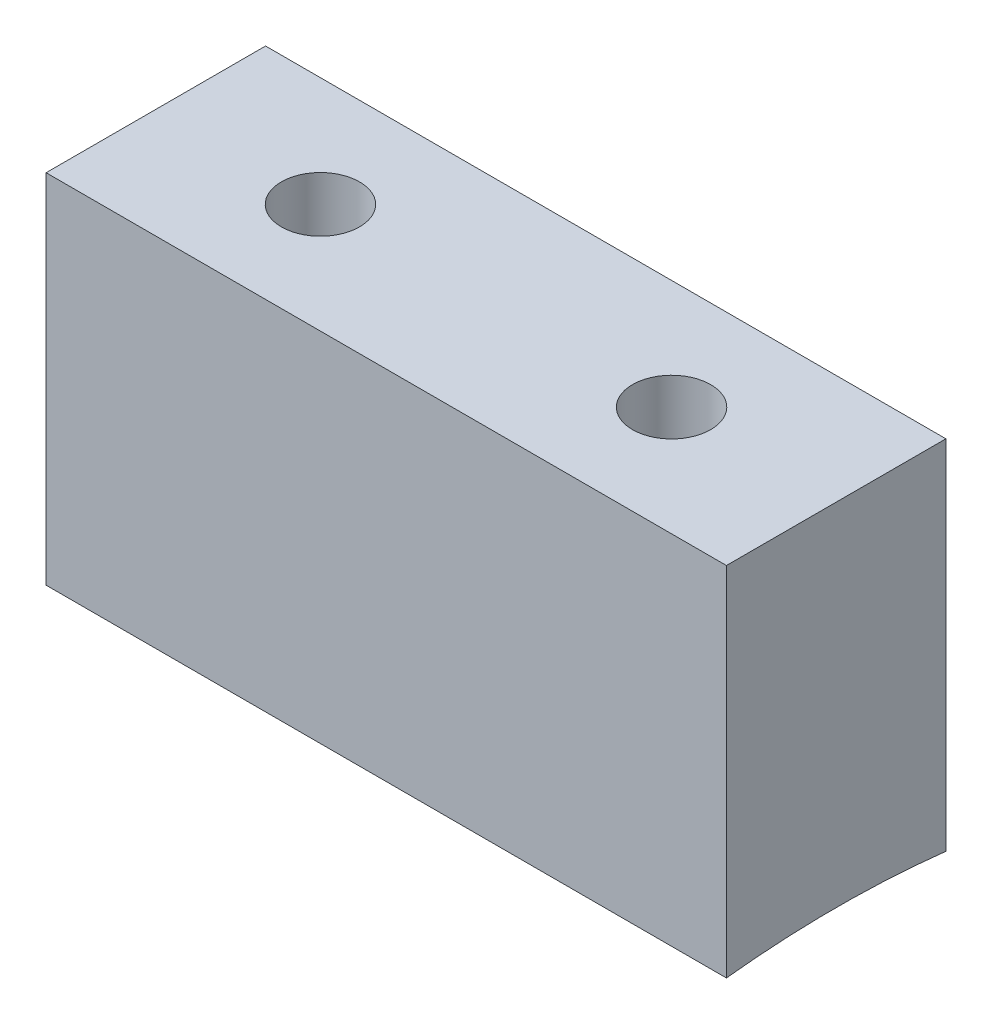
ISO-10303-21;
HEADER;
FILE_DESCRIPTION(('STEP AP214'),'2;1');
FILE_NAME('part.step','',(''),(''),'','','');
FILE_SCHEMA(('AUTOMOTIVE_DESIGN { 1 0 10303 214 1 1 1 1 }'));
ENDSEC;
DATA;
#1=APPLICATION_CONTEXT('core data for automotive mechanical design processes');
#2=APPLICATION_PROTOCOL_DEFINITION('international standard','automotive_design',2000,#1);
#3=PRODUCT_CONTEXT('',#1,'mechanical');
#4=PRODUCT('Part','Part','',(#3));
#5=PRODUCT_RELATED_PRODUCT_CATEGORY('part','',(#4));
#6=PRODUCT_DEFINITION_FORMATION('','',#4);
#7=PRODUCT_DEFINITION_CONTEXT('part definition',#1,'design');
#8=PRODUCT_DEFINITION('design','',#6,#7);
#9=PRODUCT_DEFINITION_SHAPE('','',#8);
#10=(LENGTH_UNIT() NAMED_UNIT(*) SI_UNIT(.MILLI.,.METRE.));
#11=(NAMED_UNIT(*) PLANE_ANGLE_UNIT() SI_UNIT($,.RADIAN.));
#12=(NAMED_UNIT(*) SI_UNIT($,.STERADIAN.) SOLID_ANGLE_UNIT());
#13=UNCERTAINTY_MEASURE_WITH_UNIT(LENGTH_MEASURE(1.E-05),#10,'distance_accuracy_value','');
#14=(GEOMETRIC_REPRESENTATION_CONTEXT(3) GLOBAL_UNCERTAINTY_ASSIGNED_CONTEXT((#13)) GLOBAL_UNIT_ASSIGNED_CONTEXT((#10,
#11,#12)) REPRESENTATION_CONTEXT('',''));
#15=CARTESIAN_POINT('',(0.,0.,0.));
#16=DIRECTION('',(0.,0.,1.));
#17=DIRECTION('',(1.,0.,0.));
#18=AXIS2_PLACEMENT_3D('',#15,#16,#17);
#19=CARTESIAN_POINT('',(0.106166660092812,10.1594452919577,3.175));
#20=DIRECTION('',(1.00000000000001,0.,0.));
#21=DIRECTION('',(0.,1.,0.));
#22=AXIS2_PLACEMENT_3D('',#19,#20,#21);
#23=PLANE('',#22);
#24=DIRECTION('',(0.,-1.,0.));
#25=VECTOR('',#24,1.);
#26=CARTESIAN_POINT('',(0.106166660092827,10.1594452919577,-3.175));
#27=LINE('',#26,#25);
#28=CARTESIAN_POINT('',(0.106166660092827,10.1594452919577,-3.175));
#29=VERTEX_POINT('',#28);
#30=CARTESIAN_POINT('',(0.106166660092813,-0.176936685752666,-3.175));
#31=VERTEX_POINT('',#30);
#32=EDGE_CURVE('E79',#29,#31,#27,.T.);
#33=ORIENTED_EDGE('',*,*,#32,.T.);
#34=CARTESIAN_POINT('',(0.106166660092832,-28.575,0.));
#35=DIRECTION('',(-1.00000000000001,0.,0.));
#36=DIRECTION('',(0.,-1.,0.));
#37=AXIS2_PLACEMENT_3D('',#34,#35,#36);
#38=CIRCLE('',#37,28.575);
#39=CARTESIAN_POINT('',(0.106166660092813,-0.176936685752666,3.175));
#40=VERTEX_POINT('',#39);
#41=EDGE_CURVE('E50',#40,#31,#38,.T.);
#42=ORIENTED_EDGE('',*,*,#41,.F.);
#43=DIRECTION('',(0.,-1.,0.));
#44=VECTOR('',#43,1.);
#45=CARTESIAN_POINT('',(0.106166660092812,10.1594452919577,3.175));
#46=LINE('',#45,#44);
#47=CARTESIAN_POINT('',(0.106166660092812,10.1594452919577,3.175));
#48=VERTEX_POINT('',#47);
#49=EDGE_CURVE('E84',#48,#40,#46,.T.);
#50=ORIENTED_EDGE('',*,*,#49,.F.);
#51=DIRECTION('',(0.,0.,-1.));
#52=VECTOR('',#51,1.);
#53=CARTESIAN_POINT('',(0.106166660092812,10.1594452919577,3.175));
#54=LINE('',#53,#52);
#55=EDGE_CURVE('E99',#48,#29,#54,.T.);
#56=ORIENTED_EDGE('',*,*,#55,.T.);
#57=EDGE_LOOP('',(#33,#42,#50,#56));
#58=FACE_BOUND('',#57,.T.);
#59=ADVANCED_FACE('F31',(#58),#23,.F.);
#60=CARTESIAN_POINT('',(19.791166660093,10.1594452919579,3.175));
#61=DIRECTION('',(-1.00000000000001,0.,0.));
#62=DIRECTION('',(0.,0.,1.));
#63=AXIS2_PLACEMENT_3D('',#60,#61,#62);
#64=PLANE('',#63);
#65=DIRECTION('',(0.,1.,0.));
#66=VECTOR('',#65,1.);
#67=CARTESIAN_POINT('',(19.791166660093,10.1594452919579,3.175));
#68=LINE('',#67,#66);
#69=CARTESIAN_POINT('',(19.791166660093,-0.176936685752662,3.175));
#70=VERTEX_POINT('',#69);
#71=CARTESIAN_POINT('',(19.791166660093,10.1594452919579,3.175));
#72=VERTEX_POINT('',#71);
#73=EDGE_CURVE('E89',#70,#72,#68,.T.);
#74=ORIENTED_EDGE('',*,*,#73,.F.);
#75=CARTESIAN_POINT('',(19.791166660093,-28.575,0.));
#76=DIRECTION('',(-1.00000000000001,0.,0.));
#77=DIRECTION('',(0.,-1.,0.));
#78=AXIS2_PLACEMENT_3D('',#75,#76,#77);
#79=CIRCLE('',#78,28.575);
#80=CARTESIAN_POINT('',(19.791166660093,-0.176936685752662,-3.175));
#81=VERTEX_POINT('',#80);
#82=EDGE_CURVE('E77',#70,#81,#79,.T.);
#83=ORIENTED_EDGE('',*,*,#82,.T.);
#84=DIRECTION('',(0.,1.,0.));
#85=VECTOR('',#84,1.);
#86=CARTESIAN_POINT('',(19.791166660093,10.1594452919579,-3.175));
#87=LINE('',#86,#85);
#88=CARTESIAN_POINT('',(19.791166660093,10.1594452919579,-3.175));
#89=VERTEX_POINT('',#88);
#90=EDGE_CURVE('E94',#81,#89,#87,.T.);
#91=ORIENTED_EDGE('',*,*,#90,.T.);
#92=DIRECTION('',(0.,0.,-1.));
#93=VECTOR('',#92,1.);
#94=CARTESIAN_POINT('',(19.791166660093,10.1594452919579,3.175));
#95=LINE('',#94,#93);
#96=EDGE_CURVE('E43',#72,#89,#95,.T.);
#97=ORIENTED_EDGE('',*,*,#96,.F.);
#98=EDGE_LOOP('',(#74,#83,#91,#97));
#99=FACE_BOUND('',#98,.T.);
#100=ADVANCED_FACE('F135',(#99),#64,.F.);
#101=CARTESIAN_POINT('',(0.106166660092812,10.1594452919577,3.175));
#102=DIRECTION('',(0.,-1.,0.));
#103=DIRECTION('',(1.00000000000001,0.,0.));
#104=AXIS2_PLACEMENT_3D('',#101,#102,#103);
#105=PLANE('',#104);
#106=CARTESIAN_POINT('',(15.0286666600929,10.1594452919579,0.));
#107=DIRECTION('',(0.,1.,0.));
#108=DIRECTION('',(0.,0.,1.));
#109=AXIS2_PLACEMENT_3D('',#106,#107,#108);
#110=CIRCLE('',#109,1.13029999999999);
#111=CARTESIAN_POINT('',(15.0286666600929,10.1594452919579,1.13029999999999));
#112=VERTEX_POINT('',#111);
#113=EDGE_CURVE('E158',#112,#112,#110,.T.);
#114=ORIENTED_EDGE('',*,*,#113,.F.);
#115=EDGE_LOOP('',(#114));
#116=FACE_BOUND('',#115,.T.);
#117=CARTESIAN_POINT('',(4.86866666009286,10.1594452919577,0.));
#118=DIRECTION('',(0.,1.,0.));
#119=DIRECTION('',(0.,0.,1.));
#120=AXIS2_PLACEMENT_3D('',#117,#118,#119);
#121=CIRCLE('',#120,1.13029999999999);
#122=CARTESIAN_POINT('',(4.86866666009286,10.1594452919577,1.13029999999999));
#123=VERTEX_POINT('',#122);
#124=EDGE_CURVE('E118',#123,#123,#121,.T.);
#125=ORIENTED_EDGE('',*,*,#124,.F.);
#126=EDGE_LOOP('',(#125));
#127=FACE_BOUND('',#126,.T.);
#128=ORIENTED_EDGE('',*,*,#96,.T.);
#129=DIRECTION('',(-1.00000000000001,0.,0.));
#130=VECTOR('',#129,1.);
#131=CARTESIAN_POINT('',(0.106166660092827,10.1594452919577,-3.175));
#132=LINE('',#131,#130);
#133=EDGE_CURVE('E90',#89,#29,#132,.T.);
#134=ORIENTED_EDGE('',*,*,#133,.T.);
#135=ORIENTED_EDGE('',*,*,#55,.F.);
#136=DIRECTION('',(-1.00000000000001,0.,0.));
#137=VECTOR('',#136,1.);
#138=CARTESIAN_POINT('',(0.106166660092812,10.1594452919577,3.175));
#139=LINE('',#138,#137);
#140=EDGE_CURVE('E57',#72,#48,#139,.T.);
#141=ORIENTED_EDGE('',*,*,#140,.F.);
#142=EDGE_LOOP('',(#128,#134,#135,#141));
#143=FACE_BOUND('',#142,.T.);
#144=ADVANCED_FACE('F105',(#116,#127,#143),#105,.F.);
#145=CARTESIAN_POINT('',(0.106166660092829,-5.38626770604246,3.175));
#146=DIRECTION('',(0.,0.,1.));
#147=DIRECTION('',(1.00000000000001,0.,0.));
#148=AXIS2_PLACEMENT_3D('',#145,#146,#147);
#149=PLANE('',#148);
#150=DIRECTION('',(-1.00000000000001,0.,0.));
#151=VECTOR('',#150,1.);
#152=CARTESIAN_POINT('',(19.791166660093,-0.176936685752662,3.175));
#153=LINE('',#152,#151);
#154=EDGE_CURVE('E74',#70,#40,#153,.T.);
#155=ORIENTED_EDGE('',*,*,#154,.F.);
#156=ORIENTED_EDGE('',*,*,#73,.T.);
#157=ORIENTED_EDGE('',*,*,#140,.T.);
#158=ORIENTED_EDGE('',*,*,#49,.T.);
#159=EDGE_LOOP('',(#155,#156,#157,#158));
#160=FACE_BOUND('',#159,.T.);
#161=ADVANCED_FACE('F88',(#160),#149,.T.);
#162=CARTESIAN_POINT('',(0.106166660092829,-5.38626770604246,-3.175));
#163=DIRECTION('',(0.,0.,1.));
#164=DIRECTION('',(1.00000000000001,0.,0.));
#165=AXIS2_PLACEMENT_3D('',#162,#163,#164);
#166=PLANE('',#165);
#167=ORIENTED_EDGE('',*,*,#90,.F.);
#168=DIRECTION('',(-1.00000000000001,0.,0.));
#169=VECTOR('',#168,1.);
#170=CARTESIAN_POINT('',(19.791166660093,-0.176936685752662,-3.175));
#171=LINE('',#170,#169);
#172=EDGE_CURVE('E11',#81,#31,#171,.T.);
#173=ORIENTED_EDGE('',*,*,#172,.T.);
#174=ORIENTED_EDGE('',*,*,#32,.F.);
#175=ORIENTED_EDGE('',*,*,#133,.F.);
#176=EDGE_LOOP('',(#167,#173,#174,#175));
#177=FACE_BOUND('',#176,.T.);
#178=ADVANCED_FACE('F109',(#177),#166,.F.);
#179=CARTESIAN_POINT('',(19.791166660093,-28.575,0.));
#180=DIRECTION('',(-1.00000000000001,0.,0.));
#181=DIRECTION('',(0.,-1.,0.));
#182=AXIS2_PLACEMENT_3D('',#179,#180,#181);
#183=CYLINDRICAL_SURFACE('',#182,28.575);
#184=CARTESIAN_POINT('',(15.028666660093,-0.0223635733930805,1.13029999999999));
#185=CARTESIAN_POINT('',(15.0921294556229,-0.0223632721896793,1.13029719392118));
#186=CARTESIAN_POINT('',(15.1556376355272,-0.0221497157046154,1.12493719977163));
#187=CARTESIAN_POINT('',(15.2809031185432,-0.0213183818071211,1.10363052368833));
#188=CARTESIAN_POINT('',(15.3426582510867,-0.0207001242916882,1.08767126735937));
#189=CARTESIAN_POINT('',(15.4625848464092,-0.0191295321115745,1.04562274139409));
#190=CARTESIAN_POINT('',(15.5207580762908,-0.0181773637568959,1.01953851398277));
#191=CARTESIAN_POINT('',(15.6318841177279,-0.0160464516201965,0.957987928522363));
#192=CARTESIAN_POINT('',(15.6848381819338,-0.0148677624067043,0.922523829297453));
#193=CARTESIAN_POINT('',(15.784075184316,-0.0124156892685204,0.843192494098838));
#194=CARTESIAN_POINT('',(15.830354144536,-0.011142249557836,0.799320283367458));
#195=CARTESIAN_POINT('',(15.9148935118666,-0.00864470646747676,0.704427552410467));
#196=CARTESIAN_POINT('',(15.9531535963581,-0.00742060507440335,0.653406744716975));
#197=CARTESIAN_POINT('',(16.0205782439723,-0.00515933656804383,0.545646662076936));
#198=CARTESIAN_POINT('',(16.0497399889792,-0.00412222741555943,0.488905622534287));
#199=CARTESIAN_POINT('',(16.098121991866,-0.00235234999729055,0.371328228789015));
#200=CARTESIAN_POINT('',(16.1173423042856,-0.00161958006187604,0.31049189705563));
#201=CARTESIAN_POINT('',(16.1452861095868,-0.000541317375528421,0.186484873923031));
#202=CARTESIAN_POINT('',(16.1540151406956,-0.000195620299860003,0.123315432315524));
#203=CARTESIAN_POINT('',(16.1607456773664,7.02181342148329E-05,-0.00359303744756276));
#204=CARTESIAN_POINT('',(16.1587472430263,-9.63812332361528E-06,-0.0673320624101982));
#205=CARTESIAN_POINT('',(16.1440842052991,-0.00058573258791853,-0.193532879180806));
#206=CARTESIAN_POINT('',(16.1314255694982,-0.00108173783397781,-0.255995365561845));
#207=CARTESIAN_POINT('',(16.0958107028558,-0.00243397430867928,-0.377908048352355));
#208=CARTESIAN_POINT('',(16.0728544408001,-0.00329020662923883,-0.437358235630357));
#209=CARTESIAN_POINT('',(16.0172891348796,-0.00526681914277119,-0.551577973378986));
#210=CARTESIAN_POINT('',(15.9846773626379,-0.00638727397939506,-0.606346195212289));
#211=CARTESIAN_POINT('',(15.9107287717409,-0.00876609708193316,-0.709632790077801));
#212=CARTESIAN_POINT('',(15.8693919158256,-0.0100244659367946,-0.758151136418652));
#213=CARTESIAN_POINT('',(15.7791327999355,-0.0125383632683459,-0.847595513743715));
#214=CARTESIAN_POINT('',(15.7302053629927,-0.0137938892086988,-0.888516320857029));
#215=CARTESIAN_POINT('',(15.6261721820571,-0.0161596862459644,-0.961563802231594));
#216=CARTESIAN_POINT('',(15.5710664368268,-0.0172699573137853,-0.993690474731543));
#217=CARTESIAN_POINT('',(15.4562378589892,-0.0192199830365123,-1.04823720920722));
#218=CARTESIAN_POINT('',(15.3965149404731,-0.0200597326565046,-1.07065709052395));
#219=CARTESIAN_POINT('',(15.2741486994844,-0.0213738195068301,-1.10515040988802));
#220=CARTESIAN_POINT('',(15.2115053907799,-0.021848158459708,-1.11722389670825));
#221=CARTESIAN_POINT('',(15.0851220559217,-0.0223776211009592,-1.13067527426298));
#222=CARTESIAN_POINT('',(15.0213828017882,-0.0224330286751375,-1.13206040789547));
#223=CARTESIAN_POINT('',(14.8945769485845,-0.0221191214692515,-1.12411464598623));
#224=CARTESIAN_POINT('',(14.8315103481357,-0.0217498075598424,-1.11478377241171));
#225=CARTESIAN_POINT('',(14.7078602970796,-0.020628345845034,-1.08567686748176));
#226=CARTESIAN_POINT('',(14.6472760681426,-0.0198763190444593,-1.06590413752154));
#227=CARTESIAN_POINT('',(14.5302865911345,-0.0180743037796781,-1.01647813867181));
#228=CARTESIAN_POINT('',(14.4738813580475,-0.0170243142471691,-0.986824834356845));
#229=CARTESIAN_POINT('',(14.3668176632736,-0.0147440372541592,-0.918460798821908));
#230=CARTESIAN_POINT('',(14.3161623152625,-0.0135136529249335,-0.879745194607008));
#231=CARTESIAN_POINT('',(14.2220676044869,-0.0110116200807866,-0.7943626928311));
#232=CARTESIAN_POINT('',(14.1786282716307,-0.00973997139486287,-0.747695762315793));
#233=CARTESIAN_POINT('',(14.1001744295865,-0.0072979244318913,-0.647704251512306));
#234=CARTESIAN_POINT('',(14.0651645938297,-0.00612758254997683,-0.594376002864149));
#235=CARTESIAN_POINT('',(14.0045954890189,-0.00402086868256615,-0.482594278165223));
#236=CARTESIAN_POINT('',(13.9790361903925,-0.00308449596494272,-0.42414081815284));
#237=CARTESIAN_POINT('',(13.9381018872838,-0.00155153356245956,-0.303785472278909));
#238=CARTESIAN_POINT('',(13.9227238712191,-0.000954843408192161,-0.241884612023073));
#239=CARTESIAN_POINT('',(13.9025787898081,-0.000168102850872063,-0.116377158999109));
#240=CARTESIAN_POINT('',(13.8978116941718,2.19487129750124E-05,-0.0527705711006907));
#241=CARTESIAN_POINT('',(13.8990241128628,-2.60025469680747E-05,0.0742962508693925));
#242=CARTESIAN_POINT('',(13.9049962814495,-0.000263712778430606,0.137756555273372));
#243=CARTESIAN_POINT('',(13.9275025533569,-0.00113983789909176,0.262772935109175));
#244=CARTESIAN_POINT('',(13.9440366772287,-0.00177825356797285,0.324329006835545));
#245=CARTESIAN_POINT('',(13.9871962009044,-0.00338391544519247,0.44379160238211));
#246=CARTESIAN_POINT('',(14.0138217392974,-0.00435116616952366,0.501698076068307));
#247=CARTESIAN_POINT('',(14.0764065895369,-0.00650559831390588,0.612218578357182));
#248=CARTESIAN_POINT('',(14.1123655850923,-0.00769277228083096,0.664832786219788));
#249=CARTESIAN_POINT('',(14.1926213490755,-0.0101542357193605,0.763310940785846));
#250=CARTESIAN_POINT('',(14.2369229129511,-0.0114285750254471,0.809170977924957));
#251=CARTESIAN_POINT('',(14.3326091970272,-0.0139205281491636,0.892816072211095));
#252=CARTESIAN_POINT('',(14.3839956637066,-0.0151381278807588,0.930599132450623));
#253=CARTESIAN_POINT('',(14.4924215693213,-0.0173798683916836,0.997028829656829));
#254=CARTESIAN_POINT('',(14.549465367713,-0.018403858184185,1.02566834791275));
#255=CARTESIAN_POINT('',(14.6675122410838,-0.0201403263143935,1.07292991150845));
#256=CARTESIAN_POINT('',(14.7285105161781,-0.0208531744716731,1.09156385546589));
#257=CARTESIAN_POINT('',(14.8296873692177,-0.0216971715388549,1.11336806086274));
#258=CARTESIAN_POINT('',(14.8692097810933,-0.0219459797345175,1.11970950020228));
#259=CARTESIAN_POINT('',(14.9487043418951,-0.0222792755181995,1.12817635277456));
#260=CARTESIAN_POINT('',(14.9886764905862,-0.0223637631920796,1.13030176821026));
#261=CARTESIAN_POINT('',(15.028666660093,-0.0223635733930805,1.13029999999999));
#262=B_SPLINE_CURVE_WITH_KNOTS('',3,(#184,#185,#186,#187,#188,#189,#190,#191,#192,#193,#194,
#195,#196,#197,#198,#199,#200,#201,#202,#203,#204,#205,#206,#207,#208,#209,#210,#211,#212,#213,
#214,#215,#216,#217,#218,#219,#220,#221,#222,#223,#224,#225,#226,#227,#228,#229,#230,#231,#232,
#233,#234,#235,#236,#237,#238,#239,#240,#241,#242,#243,#244,#245,#246,#247,#248,#249,#250,#251,
#252,#253,#254,#255,#256,#257,#258,#259,#260,#261),.UNSPECIFIED.,.T.,.F.,(4,2,2,2,2,2,2,2,2,2,2,
2,2,2,2,2,2,2,2,2,2,2,2,2,2,2,2,2,2,2,2,2,2,2,2,2,2,2,4),(0.,0.19024241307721,0.380710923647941,
0.571084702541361,0.761412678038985,0.95185361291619,1.14230220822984,1.33280973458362,
1.52331621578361,1.71372208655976,1.9041268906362,2.094425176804,2.28472403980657,
2.4750767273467,2.66543022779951,2.85591412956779,3.04639806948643,3.2368855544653,
3.42737214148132,3.61772963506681,3.80808673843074,3.99838369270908,4.18868132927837,
4.37908152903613,4.56948251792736,4.75998882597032,4.95049453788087,5.14094387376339,
5.33139266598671,5.52171123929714,5.71203018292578,5.90235174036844,6.09266684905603,
6.2830916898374,6.47356355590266,6.66418335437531,6.85457596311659,6.97445455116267,
7.09433307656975),.UNSPECIFIED.);
#263=CARTESIAN_POINT('',(15.028666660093,-0.0223635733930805,1.13029999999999));
#264=VERTEX_POINT('',#263);
#265=EDGE_CURVE('E34',#264,#264,#262,.T.);
#266=ORIENTED_EDGE('',*,*,#265,.T.);
#267=EDGE_LOOP('',(#266));
#268=FACE_BOUND('',#267,.T.);
#269=CARTESIAN_POINT('',(4.86866666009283,-0.022363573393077,1.13029999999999));
#270=CARTESIAN_POINT('',(4.93212945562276,-0.0223632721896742,1.13029719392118));
#271=CARTESIAN_POINT('',(4.99563763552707,-0.0221497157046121,1.12493719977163));
#272=CARTESIAN_POINT('',(5.12090311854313,-0.0213183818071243,1.10363052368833));
#273=CARTESIAN_POINT('',(5.18265825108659,-0.0207001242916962,1.08767126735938));
#274=CARTESIAN_POINT('',(5.3025848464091,-0.0191295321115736,1.04562274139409));
#275=CARTESIAN_POINT('',(5.36075807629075,-0.0181773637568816,1.01953851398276));
#276=CARTESIAN_POINT('',(5.47188411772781,-0.016046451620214,0.957987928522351));
#277=CARTESIAN_POINT('',(5.52483818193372,-0.0148677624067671,0.922523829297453));
#278=CARTESIAN_POINT('',(5.6240751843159,-0.0124156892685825,0.843192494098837));
#279=CARTESIAN_POINT('',(5.67035414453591,-0.0111422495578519,0.799320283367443));
#280=CARTESIAN_POINT('',(5.75489351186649,-0.0086447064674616,0.704427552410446));
#281=CARTESIAN_POINT('',(5.793153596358,-0.00742060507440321,0.653406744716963));
#282=CARTESIAN_POINT('',(5.86057824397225,-0.00515933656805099,0.545646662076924));
#283=CARTESIAN_POINT('',(5.88973998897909,-0.00412222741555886,0.488905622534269));
#284=CARTESIAN_POINT('',(5.93812199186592,-0.00235234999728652,0.371328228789));
#285=CARTESIAN_POINT('',(5.95734230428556,-0.00161958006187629,0.310491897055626));
#286=CARTESIAN_POINT('',(5.98528610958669,-0.00054131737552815,0.186484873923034));
#287=CARTESIAN_POINT('',(5.99401514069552,-0.000195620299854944,0.123315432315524));
#288=CARTESIAN_POINT('',(6.00074567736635,7.02181342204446E-05,-0.00359303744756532));
#289=CARTESIAN_POINT('',(5.99874724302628,-9.63812332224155E-06,-0.067332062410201));
#290=CARTESIAN_POINT('',(5.98408420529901,-0.000585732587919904,-0.193532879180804));
#291=CARTESIAN_POINT('',(5.97142556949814,-0.0010817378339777,-0.255995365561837));
#292=CARTESIAN_POINT('',(5.93581070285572,-0.00243397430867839,-0.377908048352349));
#293=CARTESIAN_POINT('',(5.91285444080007,-0.00329020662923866,-0.437358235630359));
#294=CARTESIAN_POINT('',(5.85728913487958,-0.00526681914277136,-0.551577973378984));
#295=CARTESIAN_POINT('',(5.82467736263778,-0.00638727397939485,-0.606346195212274));
#296=CARTESIAN_POINT('',(5.75072877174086,-0.00876609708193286,-0.709632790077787));
#297=CARTESIAN_POINT('',(5.70939191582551,-0.0100244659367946,-0.758151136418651));
#298=CARTESIAN_POINT('',(5.61913279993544,-0.0125383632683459,-0.847595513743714));
#299=CARTESIAN_POINT('',(5.57020536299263,-0.0137938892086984,-0.888516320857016));
#300=CARTESIAN_POINT('',(5.46617218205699,-0.0161596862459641,-0.96156380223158));
#301=CARTESIAN_POINT('',(5.41106643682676,-0.0172699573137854,-0.993690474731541));
#302=CARTESIAN_POINT('',(5.29623785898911,-0.0192199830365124,-1.04823720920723));
#303=CARTESIAN_POINT('',(5.23651494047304,-0.0200597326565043,-1.07065709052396));
#304=CARTESIAN_POINT('',(5.1141486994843,-0.0213738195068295,-1.10515040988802));
#305=CARTESIAN_POINT('',(5.05150539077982,-0.0218481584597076,-1.11722389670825));
#306=CARTESIAN_POINT('',(4.92512205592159,-0.0223776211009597,-1.13067527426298));
#307=CARTESIAN_POINT('',(4.86138280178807,-0.0224330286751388,-1.13206040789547));
#308=CARTESIAN_POINT('',(4.7345769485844,-0.0221191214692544,-1.12411464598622));
#309=CARTESIAN_POINT('',(4.67151034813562,-0.0217498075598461,-1.11478377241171));
#310=CARTESIAN_POINT('',(4.54786029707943,-0.0206283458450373,-1.08567686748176));
#311=CARTESIAN_POINT('',(4.4872760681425,-0.0198763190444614,-1.06590413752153));
#312=CARTESIAN_POINT('',(4.3702865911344,-0.0180743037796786,-1.0164781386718));
#313=CARTESIAN_POINT('',(4.31388135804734,-0.0170243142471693,-0.986824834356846));
#314=CARTESIAN_POINT('',(4.20681766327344,-0.0147440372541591,-0.918460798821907));
#315=CARTESIAN_POINT('',(4.15616231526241,-0.0135136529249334,-0.879745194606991));
#316=CARTESIAN_POINT('',(4.06206760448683,-0.0110116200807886,-0.794362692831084));
#317=CARTESIAN_POINT('',(4.01862827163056,-0.00973997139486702,-0.747695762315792));
#318=CARTESIAN_POINT('',(3.94017442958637,-0.00729792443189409,-0.647704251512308));
#319=CARTESIAN_POINT('',(3.90516459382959,-0.00612758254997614,-0.594376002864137));
#320=CARTESIAN_POINT('',(3.8445954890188,-0.00402086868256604,-0.482594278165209));
#321=CARTESIAN_POINT('',(3.81903619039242,-0.00308449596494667,-0.424140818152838));
#322=CARTESIAN_POINT('',(3.77810188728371,-0.00155153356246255,-0.303785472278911));
#323=CARTESIAN_POINT('',(3.76272387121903,-0.000954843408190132,-0.241884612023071));
#324=CARTESIAN_POINT('',(3.74257878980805,-0.000168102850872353,-0.116377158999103));
#325=CARTESIAN_POINT('',(3.73781169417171,2.19487129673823E-05,-0.0527705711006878));
#326=CARTESIAN_POINT('',(3.73902411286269,-2.60025469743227E-05,0.0742962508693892));
#327=CARTESIAN_POINT('',(3.74499628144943,-0.000263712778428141,0.137756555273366));
#328=CARTESIAN_POINT('',(3.76750255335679,-0.00113983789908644,0.262772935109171));
#329=CARTESIAN_POINT('',(3.78403667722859,-0.0017782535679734,0.324329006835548));
#330=CARTESIAN_POINT('',(3.82719620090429,-0.00338391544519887,0.443791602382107));
#331=CARTESIAN_POINT('',(3.85382173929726,-0.00435116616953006,0.501698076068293));
#332=CARTESIAN_POINT('',(3.9164065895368,-0.00650559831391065,0.612218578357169));
#333=CARTESIAN_POINT('',(3.95236558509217,-0.0076927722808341,0.664832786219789));
#334=CARTESIAN_POINT('',(4.03262134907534,-0.0101542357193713,0.763310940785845));
#335=CARTESIAN_POINT('',(4.07692291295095,-0.0114285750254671,0.80917097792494));
#336=CARTESIAN_POINT('',(4.17260919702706,-0.0139205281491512,0.892816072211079));
#337=CARTESIAN_POINT('',(4.22399566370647,-0.0151381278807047,0.930599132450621));
#338=CARTESIAN_POINT('',(4.33242156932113,-0.0173798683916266,0.99702882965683));
#339=CARTESIAN_POINT('',(4.3894653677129,-0.0184038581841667,1.02566834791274));
#340=CARTESIAN_POINT('',(4.50751224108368,-0.0201403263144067,1.07292991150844));
#341=CARTESIAN_POINT('',(4.56851051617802,-0.0208531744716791,1.09156385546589));
#342=CARTESIAN_POINT('',(4.66968736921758,-0.0216971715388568,1.11336806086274));
#343=CARTESIAN_POINT('',(4.70920978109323,-0.0219459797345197,1.11970950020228));
#344=CARTESIAN_POINT('',(4.78870434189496,-0.0222792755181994,1.12817635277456));
#345=CARTESIAN_POINT('',(4.82867649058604,-0.0223637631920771,1.13030176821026));
#346=CARTESIAN_POINT('',(4.86866666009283,-0.022363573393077,1.13029999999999));
#347=B_SPLINE_CURVE_WITH_KNOTS('',3,(#269,#270,#271,#272,#273,#274,#275,#276,#277,#278,#279,
#280,#281,#282,#283,#284,#285,#286,#287,#288,#289,#290,#291,#292,#293,#294,#295,#296,#297,#298,
#299,#300,#301,#302,#303,#304,#305,#306,#307,#308,#309,#310,#311,#312,#313,#314,#315,#316,#317,
#318,#319,#320,#321,#322,#323,#324,#325,#326,#327,#328,#329,#330,#331,#332,#333,#334,#335,#336,
#337,#338,#339,#340,#341,#342,#343,#344,#345,#346),.UNSPECIFIED.,.T.,.F.,(4,2,2,2,2,2,2,2,2,2,2,
2,2,2,2,2,2,2,2,2,2,2,2,2,2,2,2,2,2,2,2,2,2,2,2,2,2,2,4),(0.,0.190242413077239,0.380710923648,
0.571084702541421,0.761412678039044,0.95185361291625,1.14230220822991,1.33280973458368,
1.52331621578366,1.7137220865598,1.90412689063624,2.09442517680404,2.28472403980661,
2.47507672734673,2.66543022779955,2.85591412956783,3.04639806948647,3.23688555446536,
3.42737214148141,3.6177296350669,3.80808673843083,3.99838369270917,4.18868132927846,
4.37908152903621,4.56948251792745,4.7599888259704,4.95049453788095,5.14094387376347,
5.33139266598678,5.52171123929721,5.71203018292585,5.9023517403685,6.09266684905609,
6.28309168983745,6.47356355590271,6.66418335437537,6.85457596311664,6.97445455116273,
7.0943330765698),.UNSPECIFIED.);
#348=CARTESIAN_POINT('',(4.86866666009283,-0.022363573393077,1.13029999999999));
#349=VERTEX_POINT('',#348);
#350=EDGE_CURVE('E86',#349,#349,#347,.T.);
#351=ORIENTED_EDGE('',*,*,#350,.T.);
#352=EDGE_LOOP('',(#351));
#353=FACE_BOUND('',#352,.T.);
#354=ORIENTED_EDGE('',*,*,#154,.T.);
#355=ORIENTED_EDGE('',*,*,#41,.T.);
#356=ORIENTED_EDGE('',*,*,#172,.F.);
#357=ORIENTED_EDGE('',*,*,#82,.F.);
#358=EDGE_LOOP('',(#354,#355,#356,#357));
#359=FACE_BOUND('',#358,.T.);
#360=ADVANCED_FACE('F75',(#268,#353,#359),#183,.F.);
#361=CARTESIAN_POINT('',(4.86866666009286,10.1594452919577,0.));
#362=DIRECTION('',(0.,1.,0.));
#363=DIRECTION('',(0.,0.,1.));
#364=AXIS2_PLACEMENT_3D('',#361,#362,#363);
#365=CYLINDRICAL_SURFACE('',#364,1.13029999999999);
#366=ORIENTED_EDGE('',*,*,#124,.T.);
#367=EDGE_LOOP('',(#366));
#368=FACE_BOUND('',#367,.T.);
#369=ORIENTED_EDGE('',*,*,#350,.F.);
#370=EDGE_LOOP('',(#369));
#371=FACE_BOUND('',#370,.T.);
#372=ADVANCED_FACE('F122',(#368,#371),#365,.F.);
#373=CARTESIAN_POINT('',(15.0286666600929,10.1594452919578,0.));
#374=DIRECTION('',(0.,1.,0.));
#375=DIRECTION('',(0.,0.,1.));
#376=AXIS2_PLACEMENT_3D('',#373,#374,#375);
#377=CYLINDRICAL_SURFACE('',#376,1.13029999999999);
#378=ORIENTED_EDGE('',*,*,#113,.T.);
#379=EDGE_LOOP('',(#378));
#380=FACE_BOUND('',#379,.T.);
#381=ORIENTED_EDGE('',*,*,#265,.F.);
#382=EDGE_LOOP('',(#381));
#383=FACE_BOUND('',#382,.T.);
#384=ADVANCED_FACE('F125',(#380,#383),#377,.F.);
#385=CLOSED_SHELL('',(#59,#100,#144,#161,#178,#360,#372,#384));
#386=MANIFOLD_SOLID_BREP('B2',#385);
#387=ADVANCED_BREP_SHAPE_REPRESENTATION('',(#18,#386),#14);
#388=SHAPE_DEFINITION_REPRESENTATION(#9,#387);
ENDSEC;
END-ISO-10303-21;
